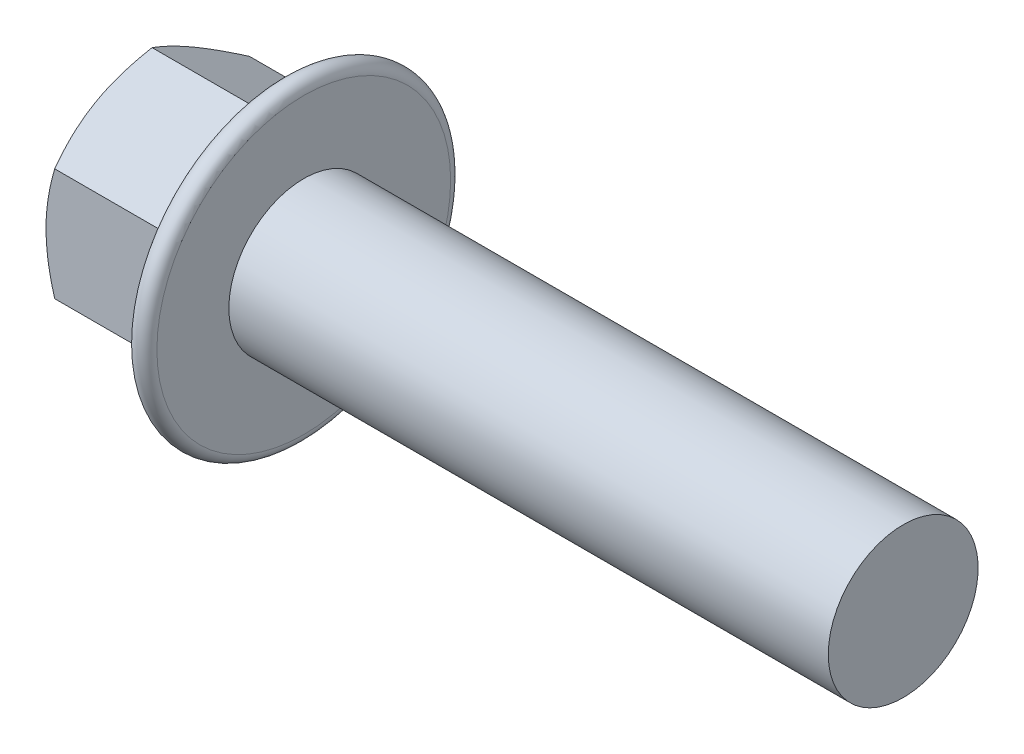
from build123d import *

# Parameters (mm, degrees)
HEX_DIE_START     = -1e-06
SKETCH2_R         = 7.580831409
HEX_DIE_DEPTH     = 10.700001
FLANGEHEXFILLET_R = 0.6
SKETCH4_R         = 5.6875
INDENT_DEPTH      = 0.891666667


with BuildPart() as part:
    # BodySke → Base-Revolve (revolve)
    with BuildSketch(Plane.XY, mode=Mode.PRIVATE) as base_revolve_sk:
        Polygon((10.7, 5), (10.7, 7.505773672), (0.5806837, 7.505773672), (0, 6.5), (0, 0), (50.7, 0), (50.7, 5), align=None)
    revolve(base_revolve_sk.sketch.rotate(Axis((-25.4, 0, 0), (1, 0, 0)), 90), axis=Axis((-25.4, 0, 0), (1, 0, 0)))

    # Sketch2 → Hex-Die (cut)
    with BuildSketch(Plane(origin=(0, 0, 0), x_dir=(0, 0, -1), z_dir=(1, 0, 0)).offset(HEX_DIE_START)):
        Circle(SKETCH2_R)
        Polygon((-6.5, 3.752776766), (0, 7.505553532), (6.5, 3.752776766), (6.5, -3.752776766), (0, -7.505553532), (-6.5, -3.752776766), align=None, mode=Mode.SUBTRACT)
    extrude(amount=HEX_DIE_DEPTH, mode=Mode.SUBTRACT)

    # Sketch5 → Flange (revolve)
    with BuildSketch(Plane.XY, mode=Mode.PRIVATE) as flange_sk:
        with BuildLine():
            Line((5.688167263, 0), (9.342215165, 10.0394141))
            ThreePointArc((9.342215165, 10.0394141), (10.121553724, 10.489365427), (10.7, 9.8))
            Line((10.7, 9.8), (10.7, 0))
            Line((10.7, 0), (5.688167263, 0))
        make_face()
    revolve(flange_sk.sketch.rotate(Axis((0, 0, 0), (1, 0, 0)), 90), axis=Axis((0, 0, 0), (1, 0, 0)))

    # FlangeHexFillet
    flangehexfillet_edges = [part.edges().sort_by_distance(p)[0] for p in [
        (8.151404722, 1.884573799, 6.5),
        (8.053973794, 5.629165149, 3.25),
        (8.053973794, 5.629165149, -3.25),
        (8.053973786, 0, -6.5),
        (8.053973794, -5.629165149, -3.25),
        (8.053973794, -5.629165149, 3.25),
        (8.151404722, -1.884573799, 6.5),
    ]]
    fillet(flangehexfillet_edges, radius=FLANGEHEXFILLET_R)

    # Sketch4 → Indent (cut)
    with BuildSketch(Plane(origin=(0, 0, 0), x_dir=(0, 0, -1), z_dir=(1, 0, 0))):
        Circle(SKETCH4_R)
    extrude(amount=INDENT_DEPTH, mode=Mode.SUBTRACT)


solid = part.part
